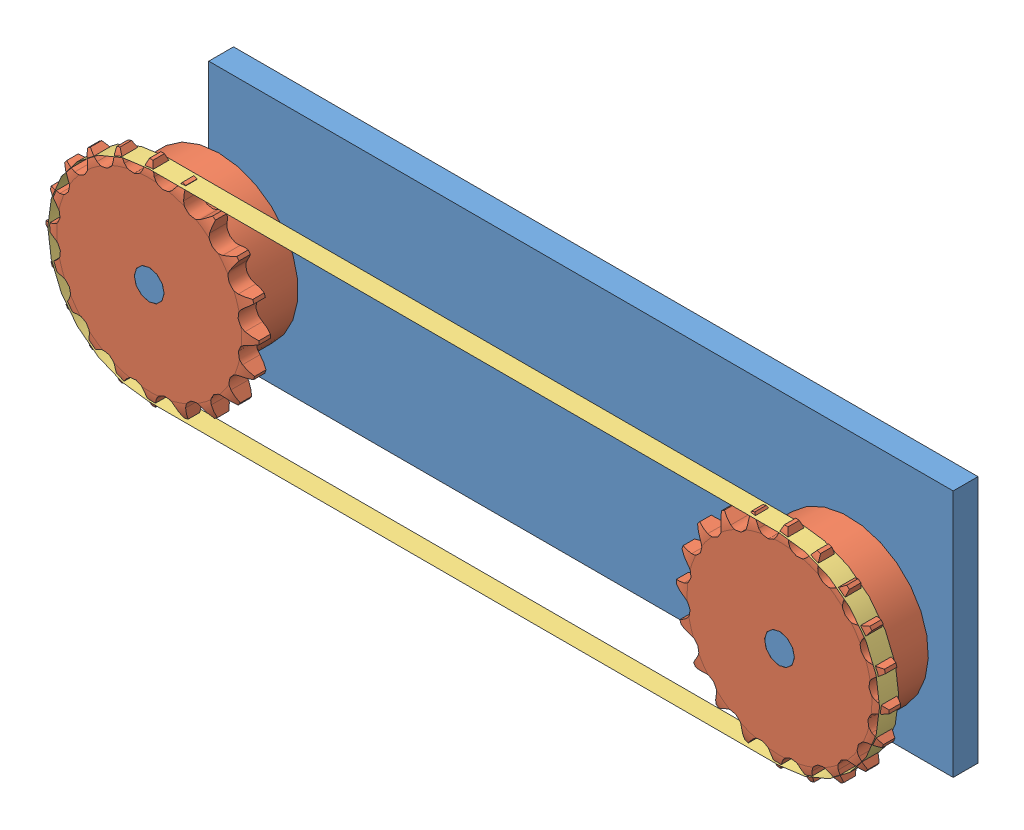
SolidWorks assembly Fertige_Kette_9.SLDASM, configuration Standard (file format 3400). Lengths in mm.
Overall size (368.71 115.57 50.71).
4 component instances, 3 part files, 7 mates.
Components (placement in the parent):
- Grundgeruest_9-1: Grundgeruest_9.SLDPRT [Standard] at (0 0 -10) size (300 100 50)
- madler_105_881_20_Kettenrad_6-1: madler_105_881_20_Kettenrad_6.sldprt [Default] at (16.018 50 40) x (-0.46409 0.885788 0) z (0.885788 0.46409 0) size (85.61 28.71 85.61)
- madler_105_881_20_Kettenrad_6-2: madler_105_881_20_Kettenrad_6.sldprt [Default] at (270 50 40) x (0.905229 0.424924 0) z (0.424924 -0.905229 0) size (85.61 28.71 85.61)
- Riemen9-1: Riemen9.SLDPRT [Standard] at (270 50 36.4) x (-1 0 0) z (0 0 -1) size (335.17 81.19 7.75)
Mates (geometry in assembly coordinates):
- Konzentrisch15: concentric: cylinder of Grundgeruest_9-1; cylinder of madler_105_881_20_Kettenrad_6-1
- Deckungsgleich25: coincident aligned: plane of Grundgeruest_9-1 through (16.018 50 40) normal (0 0 1); plane of madler_105_881_20_Kettenrad_6-1 through (-2.9822 40.0453 40) normal (0 0 1)
- Konzentrisch24: concentric aligned: cylinder of Grundgeruest_9-1; cylinder of madler_105_881_20_Kettenrad_6-2
- Deckungsgleich36: coincident aligned: plane of Grundgeruest_9-1 through (270 50 40) normal (0 0 1); plane of madler_105_881_20_Kettenrad_6-2 through (260.8854 69.4172 40) normal (0 0 1)
- Riemenverknüpfung1: belt = 64 mm: cylinder of madler_105_881_20_Kettenrad_6-1; cylinder of madler_105_881_20_Kettenrad_6-2
- Deckungsgleich39: coincident: point of Grundgeruest_9-1
- Senkrecht1: perpendicular = 763.03 mm: unknown of Grundgeruest_9-1
